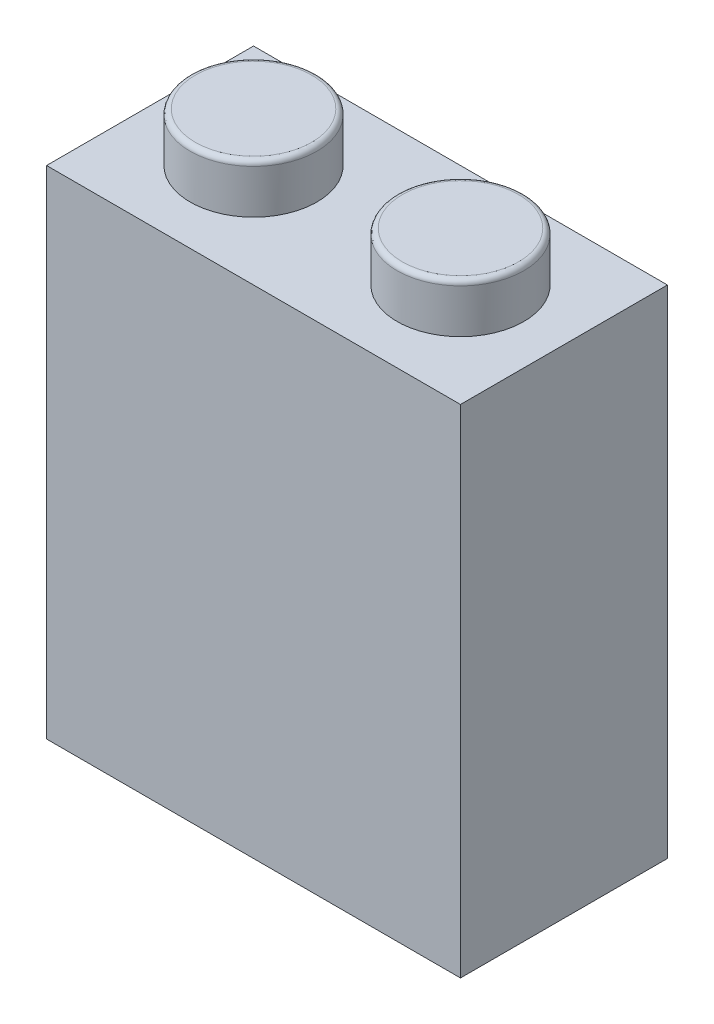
from build123d import *
from OCP.BRepFilletAPI import BRepFilletAPI_MakeChamfer

# Parameters (mm, degrees)
SKIZZE2_W                       = 16
SKIZZE2_H                       = 19.2
LINEAR_AUSTRAGEN1_DEPTH         = 8
SKIZZE3_R                       = 2.45
LINEAR_AUSTRAGEN2_DEPTH         = 1.9
VERRUNDUNG1_R                   = 0.2
SKIZZE4_W                       = 12.8
SKIZZE4_H                       = 4.8
SCHNITT_LINEAR_AUSTRAGEN1_DEPTH = 18.2
SKIZZE5_R                       = 1.6
SCHNITT_LINEAR_AUSTRAGEN2_DEPTH = 1.8
LINEAR_AUSTRAGEN3_DEPTH         = 17.7
FASE2_SIZE                      = 1
FASE2_SIZE2                     = 1.191753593


with BuildPart() as part:
    # Skizze2 → Linear austragen1 (new body)
    with BuildSketch(Plane.XY):
        with Locations((8, 9.6)):
            Rectangle(SKIZZE2_W, SKIZZE2_H)
    extrude(amount=LINEAR_AUSTRAGEN1_DEPTH)

    # Skizze3 → Linear austragen2 (add)
    with BuildSketch(Plane(origin=(0, 19.2, 0), x_dir=(-1, 0, 0), z_dir=(0, 1, 0))):
        with Locations(Location((-12, 4, 0), (0, 0, 270))):
            Circle(SKIZZE3_R)
        with Locations(Location((-4, 4, 0), (0, 0, 270))):
            Circle(SKIZZE3_R)
    extrude(amount=LINEAR_AUSTRAGEN2_DEPTH)

    # Verrundung1
    verrundung1_edges = [part.edges().sort_by_distance(p)[0] for p in [
        (12, 21.1, 6.45),
        (4, 21.1, 6.45),
    ]]
    fillet(verrundung1_edges, radius=VERRUNDUNG1_R)

    # Skizze4 → Schnitt-Linear austragen1 (cut)
    with BuildSketch(Plane.XZ):
        with Locations((8, 4)):
            Rectangle(SKIZZE4_W, SKIZZE4_H)
    extrude(amount=-SCHNITT_LINEAR_AUSTRAGEN1_DEPTH, mode=Mode.SUBTRACT)

    # Skizze5 → Schnitt-Linear austragen2 (cut)
    with BuildSketch(Plane.XZ.offset(-18.2)):
        with Locations(Location((4, 4, 0), (0, 0, 270))):
            Circle(SKIZZE5_R)
        with Locations(Location((12, 4, 0), (0, 0, 270))):
            Circle(SKIZZE5_R)
    extrude(amount=-SCHNITT_LINEAR_AUSTRAGEN2_DEPTH, mode=Mode.SUBTRACT)

    # Skizze6 → Linear austragen3 (add)
    with BuildSketch(Plane.XZ.offset(-18.2)):
        Polygon((7.2, 6.4), (7.2, 4.95), (6.78813933, 4.95), (5.7, 6.4), align=None)
        Polygon((9, 4.95), (9.41186067, 4.95), (10.5, 6.4), (9, 6.4), align=None)
        Polygon((7.2, 3.05), (6.78813933, 3.05), (5.7, 1.6), (7.2, 1.6), align=None)
        Polygon((9, 3.05), (9.41186067, 3.05), (10.5, 1.6), (9, 1.6), align=None)
    extrude(amount=LINEAR_AUSTRAGEN3_DEPTH)

    # Fase2: one chamfer whose edges measure the first distance from different faces: ONE call of the kernel's chamfer builder (chamfer() names one face for all edges)
    fase2_edges_1 = [part.edges().sort_by_distance(p)[0] for p in [
        (6.994069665, 0.5, 4.95),
    ]]
    fase2_side_1 = [part.faces().sort_by_distance(p)[0] for p in [
        (6.994069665, 9.35, 4.95),
    ]]
    fase2_edges_2 = [part.edges().sort_by_distance(p)[0] for p in [
        (9.205930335, 0.5, 4.95),
    ]]
    fase2_side_2 = [part.faces().sort_by_distance(p)[0] for p in [
        (9.205930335, 9.35, 4.95),
    ]]
    fase2_edges_3 = [part.edges().sort_by_distance(p)[0] for p in [
        (6.994069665, 0.5, 3.05),
    ]]
    fase2_side_3 = [part.faces().sort_by_distance(p)[0] for p in [
        (6.994069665, 9.35, 3.05),
    ]]
    fase2_edges_4 = [part.edges().sort_by_distance(p)[0] for p in [
        (9.205930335, 0.5, 3.05),
    ]]
    fase2_side_4 = [part.faces().sort_by_distance(p)[0] for p in [
        (9.205930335, 9.35, 3.05),
    ]]
    fase2 = BRepFilletAPI_MakeChamfer(part.part.solid().wrapped)
    for e in fase2_edges_1:
        fase2.Add(FASE2_SIZE, FASE2_SIZE2, e.wrapped, fase2_side_1[0].wrapped)  # the first distance lies on this face
    for e in fase2_edges_2:
        fase2.Add(FASE2_SIZE, FASE2_SIZE2, e.wrapped, fase2_side_2[0].wrapped)  # the first distance lies on this face
    for e in fase2_edges_3:
        fase2.Add(FASE2_SIZE, FASE2_SIZE2, e.wrapped, fase2_side_3[0].wrapped)  # the first distance lies on this face
    for e in fase2_edges_4:
        fase2.Add(FASE2_SIZE, FASE2_SIZE2, e.wrapped, fase2_side_4[0].wrapped)  # the first distance lies on this face
    add(Compound.cast(fase2.Shape()), mode=Mode.REPLACE)


solid = part.part
